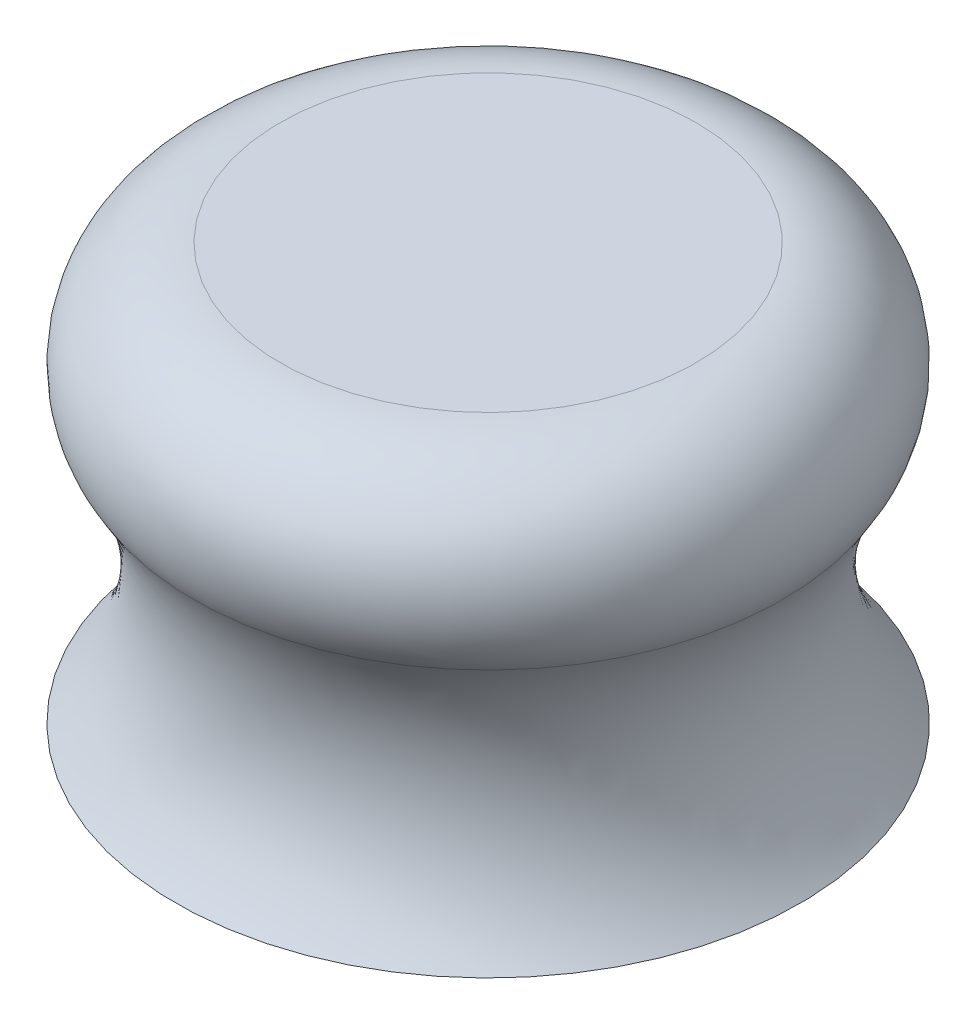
ISO-10303-21;
HEADER;
FILE_DESCRIPTION(('STEP AP214'),'2;1');
FILE_NAME('part.step','',(''),(''),'','','');
FILE_SCHEMA(('AUTOMOTIVE_DESIGN { 1 0 10303 214 1 1 1 1 }'));
ENDSEC;
DATA;
#1=APPLICATION_CONTEXT('core data for automotive mechanical design processes');
#2=APPLICATION_PROTOCOL_DEFINITION('international standard','automotive_design',2000,#1);
#3=PRODUCT_CONTEXT('',#1,'mechanical');
#4=PRODUCT('Part','Part','',(#3));
#5=PRODUCT_RELATED_PRODUCT_CATEGORY('part','',(#4));
#6=PRODUCT_DEFINITION_FORMATION('','',#4);
#7=PRODUCT_DEFINITION_CONTEXT('part definition',#1,'design');
#8=PRODUCT_DEFINITION('design','',#6,#7);
#9=PRODUCT_DEFINITION_SHAPE('','',#8);
#10=(LENGTH_UNIT() NAMED_UNIT(*) SI_UNIT(.MILLI.,.METRE.));
#11=(NAMED_UNIT(*) PLANE_ANGLE_UNIT() SI_UNIT($,.RADIAN.));
#12=(NAMED_UNIT(*) SI_UNIT($,.STERADIAN.) SOLID_ANGLE_UNIT());
#13=UNCERTAINTY_MEASURE_WITH_UNIT(LENGTH_MEASURE(1.E-05),#10,'distance_accuracy_value','');
#14=(GEOMETRIC_REPRESENTATION_CONTEXT(3) GLOBAL_UNCERTAINTY_ASSIGNED_CONTEXT((#13)) GLOBAL_UNIT_ASSIGNED_CONTEXT((#10,
#11,#12)) REPRESENTATION_CONTEXT('',''));
#15=CARTESIAN_POINT('',(0.,0.,0.));
#16=DIRECTION('',(0.,0.,1.));
#17=DIRECTION('',(1.,0.,0.));
#18=AXIS2_PLACEMENT_3D('',#15,#16,#17);
#19=CARTESIAN_POINT('',(0.,0.,0.));
#20=DIRECTION('',(0.,-1.,0.));
#21=DIRECTION('',(0.,0.,-1.));
#22=AXIS2_PLACEMENT_3D('',#19,#20,#21);
#23=PLANE('',#22);
#24=CARTESIAN_POINT('',(0.,0.,0.));
#25=DIRECTION('',(0.,-1.,0.));
#26=DIRECTION('',(0.,0.,-1.));
#27=AXIS2_PLACEMENT_3D('',#24,#25,#26);
#28=CIRCLE('',#27,30.);
#29=CARTESIAN_POINT('',(0.,0.,-30.));
#30=VERTEX_POINT('',#29);
#31=EDGE_CURVE('E10',#30,#30,#28,.T.);
#32=ORIENTED_EDGE('',*,*,#31,.T.);
#33=EDGE_LOOP('',(#32));
#34=FACE_BOUND('',#33,.T.);
#35=ADVANCED_FACE('F31',(#34),#23,.T.);
#36=CARTESIAN_POINT('',(0.,13.3094750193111,0.));
#37=DIRECTION('',(0.,-1.,0.));
#38=DIRECTION('',(0.,0.,-1.));
#39=AXIS2_PLACEMENT_3D('',#36,#37,#38);
#40=TOROIDAL_SURFACE('',#39,44.9284250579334,20.);
#41=CARTESIAN_POINT('',(0.,24.4364916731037,0.));
#42=DIRECTION('',(0.,-1.,0.));
#43=DIRECTION('',(0.,0.,-1.));
#44=AXIS2_PLACEMENT_3D('',#41,#42,#43);
#45=CIRCLE('',#44,28.3094750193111);
#46=CARTESIAN_POINT('',(0.,24.4364916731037,-28.3094750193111));
#47=VERTEX_POINT('',#46);
#48=EDGE_CURVE('E37',#47,#47,#45,.T.);
#49=ORIENTED_EDGE('',*,*,#48,.T.);
#50=EDGE_LOOP('',(#49));
#51=FACE_BOUND('',#50,.T.);
#52=ORIENTED_EDGE('',*,*,#31,.F.);
#53=EDGE_LOOP('',(#52));
#54=FACE_BOUND('',#53,.T.);
#55=ADVANCED_FACE('F57',(#51,#54),#40,.F.);
#56=CARTESIAN_POINT('',(0.,30.,0.));
#57=DIRECTION('',(0.,-1.,0.));
#58=DIRECTION('',(0.,0.,-1.));
#59=AXIS2_PLACEMENT_3D('',#56,#57,#58);
#60=TOROIDAL_SURFACE('',#59,20.,10.);
#61=CARTESIAN_POINT('',(0.,40.,0.));
#62=DIRECTION('',(0.,-1.,0.));
#63=DIRECTION('',(0.,0.,-1.));
#64=AXIS2_PLACEMENT_3D('',#61,#62,#63);
#65=CIRCLE('',#64,20.);
#66=CARTESIAN_POINT('',(0.,40.,-20.));
#67=VERTEX_POINT('',#66);
#68=EDGE_CURVE('E41',#67,#67,#65,.T.);
#69=ORIENTED_EDGE('',*,*,#68,.T.);
#70=EDGE_LOOP('',(#69));
#71=FACE_BOUND('',#70,.T.);
#72=ORIENTED_EDGE('',*,*,#48,.F.);
#73=EDGE_LOOP('',(#72));
#74=FACE_BOUND('',#73,.T.);
#75=ADVANCED_FACE('F48',(#71,#74),#60,.T.);
#76=CARTESIAN_POINT('',(0.,40.,0.));
#77=DIRECTION('',(0.,1.,0.));
#78=DIRECTION('',(0.,0.,1.));
#79=AXIS2_PLACEMENT_3D('',#76,#77,#78);
#80=PLANE('',#79);
#81=ORIENTED_EDGE('',*,*,#68,.F.);
#82=EDGE_LOOP('',(#81));
#83=FACE_BOUND('',#82,.T.);
#84=ADVANCED_FACE('F51',(#83),#80,.T.);
#85=CLOSED_SHELL('',(#35,#55,#75,#84));
#86=MANIFOLD_SOLID_BREP('B2',#85);
#87=ADVANCED_BREP_SHAPE_REPRESENTATION('',(#18,#86),#14);
#88=SHAPE_DEFINITION_REPRESENTATION(#9,#87);
ENDSEC;
END-ISO-10303-21;
